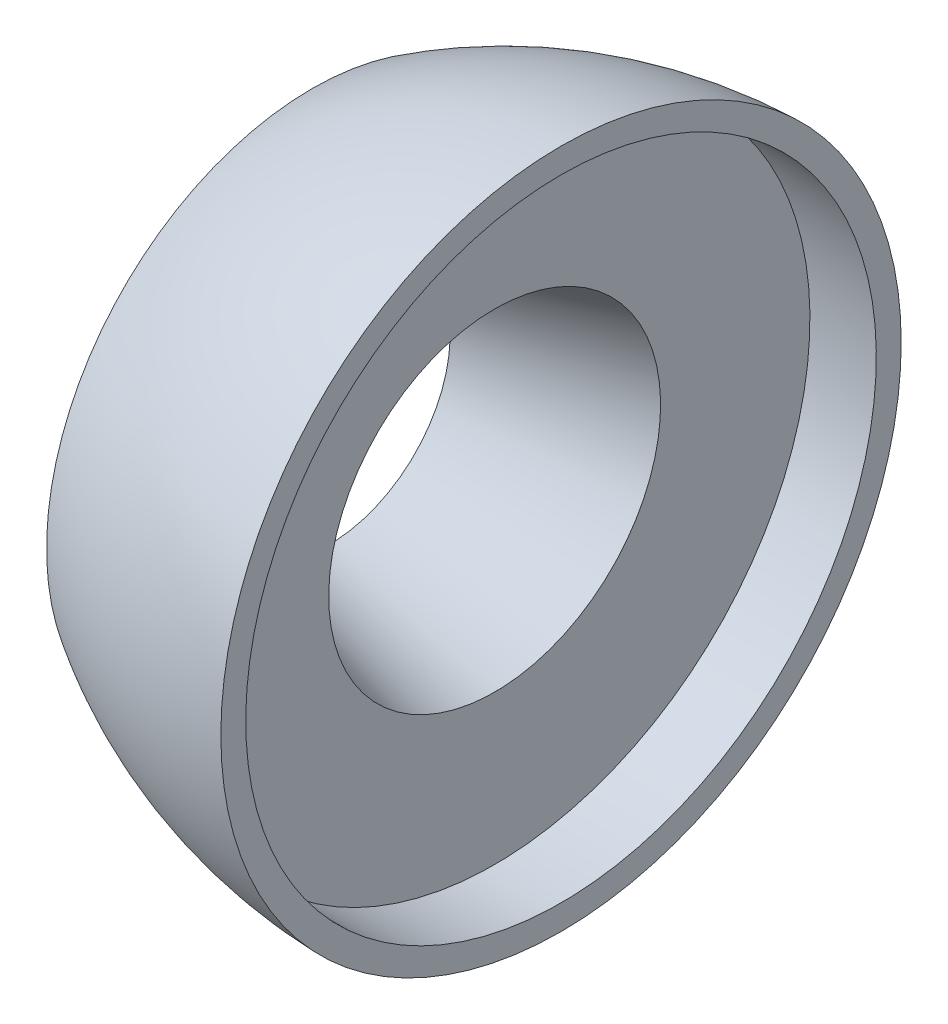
from build123d import *

# Parameters (mm, degrees)
CIRPATTERN1_COUNT = 36


with BuildPart() as part:
    # Sketch1 → Revolve1 (revolve)
    with BuildSketch(Plane.XY):
        with BuildLine():
            Line((-5, 3.660254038), (0, 5))
            Line((0, 5), (0, 9.5))
            Line((0, 9.5), (2, 9.5))
            Line((2, 9.5), (2, 10.25))
            ThreePointArc((2, 10.25), (-1.899406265, 9.623020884), (-5.5, 8))
            Line((-5.5, 8), (-5.5, 5))
            Line((-5.5, 5), (-5, 5))
            Line((-5, 5), (-5, 3.660254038))
        make_face()
    revolve(axis=Axis((0, 0, 0), (-1, 0, 0)))

    # Sketch2 → Cut-Revolve1 (revolve, cut)
    with BuildSketch(Plane.XY):
        with BuildLine():
            Line((-6.7, 0.5), (-6.7, 12.5))
            ThreePointArc((-6.7, 12.5), (-5.447727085, 6.5), (-6.7, 0.5))
        make_face()
    cut_revolve1 = revolve(axis=Axis((-6.7, 0, 0), (0, 1, 0)), mode=Mode.SUBTRACT)

    # CirPattern1: Cut-Revolve1 ×36 about axis
    cirpattern1_axis = Axis((-5.5, 0, 0), (1, 0, 0))
    for i in range(1, CIRPATTERN1_COUNT):
        add(cut_revolve1.rotate(cirpattern1_axis, i * 360 / CIRPATTERN1_COUNT), mode=Mode.SUBTRACT)


solid = part.part
